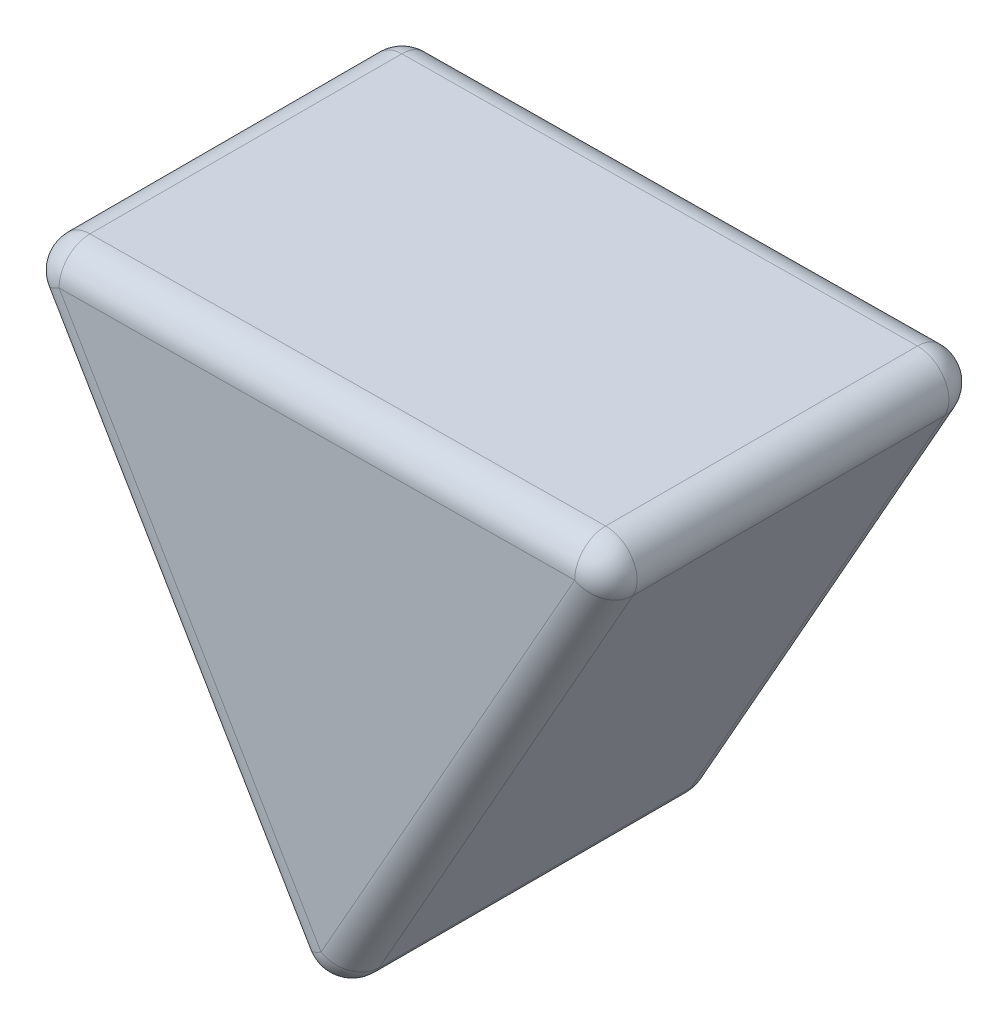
from build123d import *

# Parameters (mm, degrees)
BOSS_EXTRU_1_DEPTH = 12
CONG_1_R           = 1


with BuildPart() as part:
    # Esquisse1 → Boss.-Extru.1 (new body)
    with BuildSketch(Plane.XY):
        Polygon((-30.0533782, 5.865956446), (-50.0533782, 5.681048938), (-39.8932436, -11.547005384), align=None)
    extrude(amount=BOSS_EXTRU_1_DEPTH)

    # Cong_1
    cong_1_edges = [part.edges().sort_by_distance(p)[0] for p in [
        (-44.9733109, -2.932978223, 12),
        (-44.9733109, -2.932978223, 0),
        (-40.0533782, 5.773502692, 0),
        (-34.9733109, -2.840524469, 0),
        (-34.9733109, -2.840524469, 12),
        (-39.8932436, -11.547005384, 6),
        (-50.0533782, 5.681048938, 6),
        (-30.0533782, 5.865956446, 6),
        (-40.0533782, 5.773502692, 12),
    ]]
    fillet(cong_1_edges, radius=CONG_1_R)


solid = part.part
